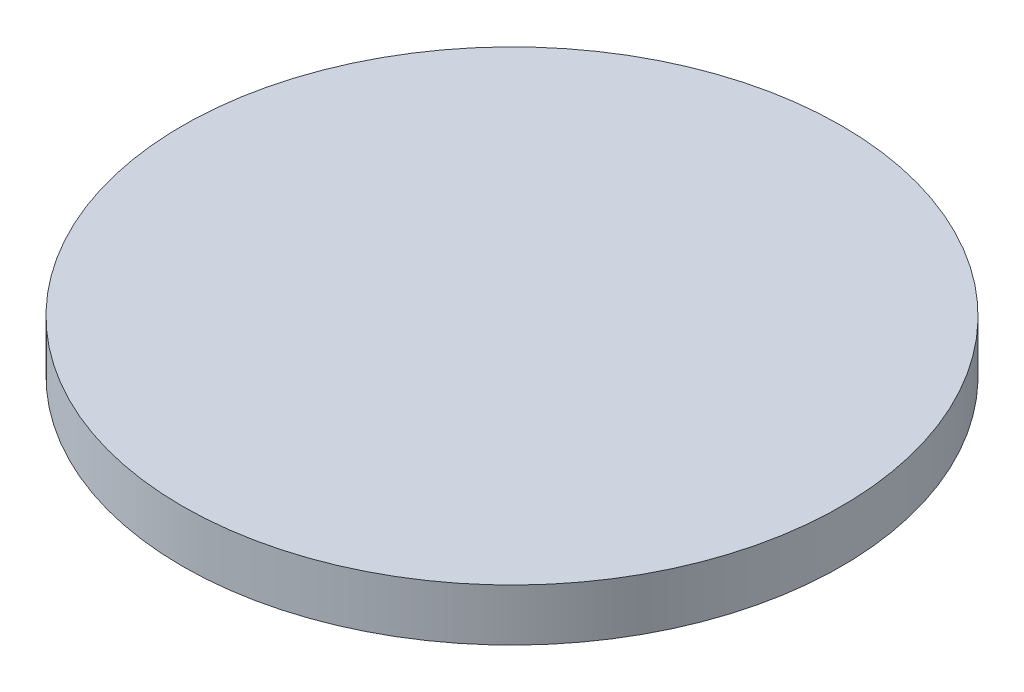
from build123d import *

# Parameters (mm, degrees)
SKETCH_1_R      = 19
EXTRUDE_1_DEPTH = 3


with BuildPart() as part:
    # Sketch 1 → Extrude 1 (new body)
    with BuildSketch(Plane(origin=(0, 0, 0), x_dir=(1, 0, 0), z_dir=(0, 1, 0))):
        with Locations(Location((0, 0, 0), (0, 0, 270))):
            Circle(SKETCH_1_R)
    extrude(amount=EXTRUDE_1_DEPTH)


solid = part.part
